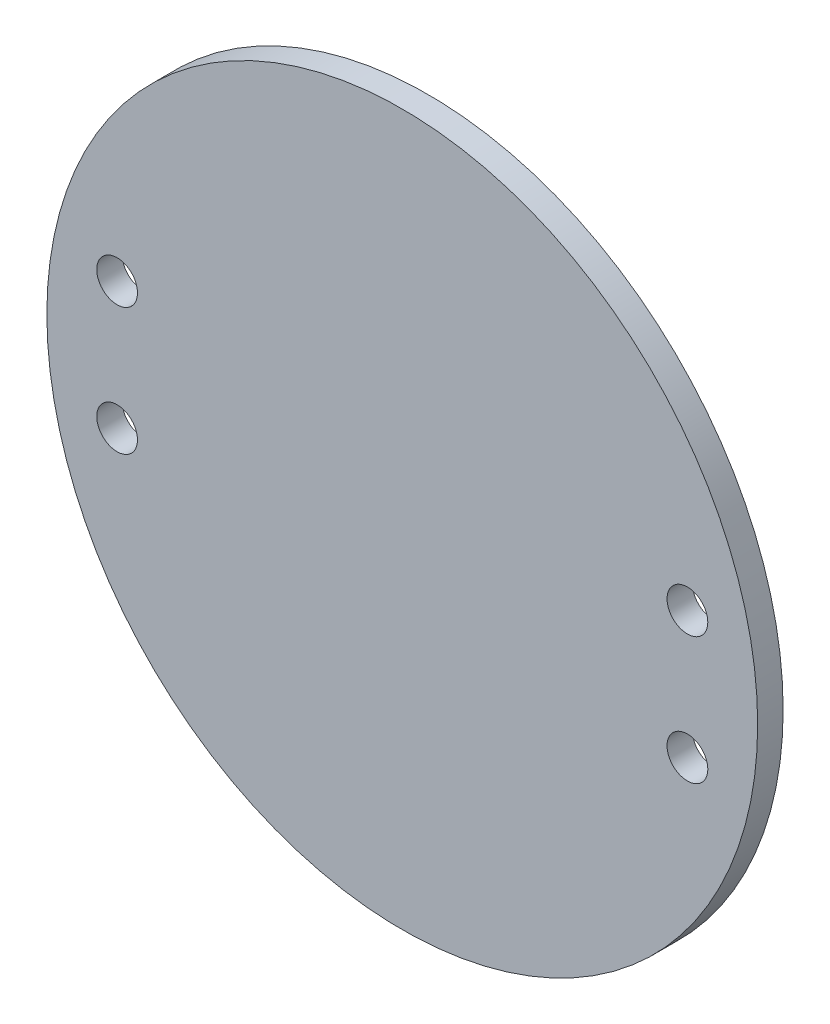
ISO-10303-21;
HEADER;
FILE_DESCRIPTION(('STEP AP214'),'2;1');
FILE_NAME('part.step','',(''),(''),'','','');
FILE_SCHEMA(('AUTOMOTIVE_DESIGN { 1 0 10303 214 1 1 1 1 }'));
ENDSEC;
DATA;
#1=APPLICATION_CONTEXT('core data for automotive mechanical design processes');
#2=APPLICATION_PROTOCOL_DEFINITION('international standard','automotive_design',2000,#1);
#3=PRODUCT_CONTEXT('',#1,'mechanical');
#4=PRODUCT('Part','Part','',(#3));
#5=PRODUCT_RELATED_PRODUCT_CATEGORY('part','',(#4));
#6=PRODUCT_DEFINITION_FORMATION('','',#4);
#7=PRODUCT_DEFINITION_CONTEXT('part definition',#1,'design');
#8=PRODUCT_DEFINITION('design','',#6,#7);
#9=PRODUCT_DEFINITION_SHAPE('','',#8);
#10=(LENGTH_UNIT() NAMED_UNIT(*) SI_UNIT(.MILLI.,.METRE.));
#11=(NAMED_UNIT(*) PLANE_ANGLE_UNIT() SI_UNIT($,.RADIAN.));
#12=(NAMED_UNIT(*) SI_UNIT($,.STERADIAN.) SOLID_ANGLE_UNIT());
#13=UNCERTAINTY_MEASURE_WITH_UNIT(LENGTH_MEASURE(1.E-05),#10,'distance_accuracy_value','');
#14=(GEOMETRIC_REPRESENTATION_CONTEXT(3) GLOBAL_UNCERTAINTY_ASSIGNED_CONTEXT((#13)) GLOBAL_UNIT_ASSIGNED_CONTEXT((#10,
#11,#12)) REPRESENTATION_CONTEXT('',''));
#15=CARTESIAN_POINT('',(0.,0.,0.));
#16=DIRECTION('',(0.,0.,1.));
#17=DIRECTION('',(1.,0.,0.));
#18=AXIS2_PLACEMENT_3D('',#15,#16,#17);
#19=CARTESIAN_POINT('',(0.,0.,1.5875));
#20=DIRECTION('',(0.,0.,1.));
#21=DIRECTION('',(1.,0.,0.));
#22=AXIS2_PLACEMENT_3D('',#19,#20,#21);
#23=PLANE('',#22);
#24=CARTESIAN_POINT('',(17.78,-3.96875,1.5875));
#25=DIRECTION('',(0.,0.,1.));
#26=DIRECTION('',(-1.,0.,0.));
#27=AXIS2_PLACEMENT_3D('',#24,#25,#26);
#28=CIRCLE('',#27,1.27);
#29=CARTESIAN_POINT('',(16.51,-3.96875,1.5875));
#30=VERTEX_POINT('',#29);
#31=EDGE_CURVE('E55',#30,#30,#28,.T.);
#32=ORIENTED_EDGE('',*,*,#31,.F.);
#33=EDGE_LOOP('',(#32));
#34=FACE_BOUND('',#33,.T.);
#35=CARTESIAN_POINT('',(-17.78,3.96875,1.5875));
#36=DIRECTION('',(0.,0.,1.));
#37=DIRECTION('',(1.,0.,0.));
#38=AXIS2_PLACEMENT_3D('',#35,#36,#37);
#39=CIRCLE('',#38,1.27);
#40=CARTESIAN_POINT('',(-16.51,3.96875,1.5875));
#41=VERTEX_POINT('',#40);
#42=EDGE_CURVE('E40',#41,#41,#39,.T.);
#43=ORIENTED_EDGE('',*,*,#42,.F.);
#44=EDGE_LOOP('',(#43));
#45=FACE_BOUND('',#44,.T.);
#46=CARTESIAN_POINT('',(0.,0.,1.5875));
#47=DIRECTION('',(0.,0.,1.));
#48=DIRECTION('',(1.,0.,0.));
#49=AXIS2_PLACEMENT_3D('',#46,#47,#48);
#50=CIRCLE('',#49,22.1615);
#51=CARTESIAN_POINT('',(22.1615,0.,1.5875));
#52=VERTEX_POINT('',#51);
#53=EDGE_CURVE('E10',#52,#52,#50,.T.);
#54=ORIENTED_EDGE('',*,*,#53,.T.);
#55=EDGE_LOOP('',(#54));
#56=FACE_BOUND('',#55,.T.);
#57=CARTESIAN_POINT('',(17.78,3.96875,1.5875));
#58=DIRECTION('',(0.,0.,1.));
#59=DIRECTION('',(1.,0.,0.));
#60=AXIS2_PLACEMENT_3D('',#57,#58,#59);
#61=CIRCLE('',#60,1.27);
#62=CARTESIAN_POINT('',(19.05,3.96875,1.5875));
#63=VERTEX_POINT('',#62);
#64=EDGE_CURVE('E49',#63,#63,#61,.T.);
#65=ORIENTED_EDGE('',*,*,#64,.F.);
#66=EDGE_LOOP('',(#65));
#67=FACE_BOUND('',#66,.T.);
#68=CARTESIAN_POINT('',(-17.78,-3.96875,1.5875));
#69=DIRECTION('',(0.,0.,1.));
#70=DIRECTION('',(-1.,0.,0.));
#71=AXIS2_PLACEMENT_3D('',#68,#69,#70);
#72=CIRCLE('',#71,1.27);
#73=CARTESIAN_POINT('',(-19.05,-3.96875,1.5875));
#74=VERTEX_POINT('',#73);
#75=EDGE_CURVE('E61',#74,#74,#72,.T.);
#76=ORIENTED_EDGE('',*,*,#75,.F.);
#77=EDGE_LOOP('',(#76));
#78=FACE_BOUND('',#77,.T.);
#79=ADVANCED_FACE('F29',(#34,#45,#56,#67,#78),#23,.T.);
#80=CARTESIAN_POINT('',(0.,0.,0.));
#81=DIRECTION('',(0.,0.,1.));
#82=DIRECTION('',(1.,0.,0.));
#83=AXIS2_PLACEMENT_3D('',#80,#81,#82);
#84=PLANE('',#83);
#85=CARTESIAN_POINT('',(17.78,-3.96875,0.));
#86=DIRECTION('',(0.,0.,1.));
#87=DIRECTION('',(-1.,0.,0.));
#88=AXIS2_PLACEMENT_3D('',#85,#86,#87);
#89=CIRCLE('',#88,1.27);
#90=CARTESIAN_POINT('',(16.51,-3.96875,0.));
#91=VERTEX_POINT('',#90);
#92=EDGE_CURVE('E58',#91,#91,#89,.T.);
#93=ORIENTED_EDGE('',*,*,#92,.T.);
#94=EDGE_LOOP('',(#93));
#95=FACE_BOUND('',#94,.T.);
#96=CARTESIAN_POINT('',(-17.78,3.96875,0.));
#97=DIRECTION('',(0.,0.,1.));
#98=DIRECTION('',(1.,0.,0.));
#99=AXIS2_PLACEMENT_3D('',#96,#97,#98);
#100=CIRCLE('',#99,1.27);
#101=CARTESIAN_POINT('',(-16.51,3.96875,0.));
#102=VERTEX_POINT('',#101);
#103=EDGE_CURVE('E44',#102,#102,#100,.T.);
#104=ORIENTED_EDGE('',*,*,#103,.T.);
#105=EDGE_LOOP('',(#104));
#106=FACE_BOUND('',#105,.T.);
#107=CARTESIAN_POINT('',(0.,0.,0.));
#108=DIRECTION('',(0.,0.,1.));
#109=DIRECTION('',(1.,0.,0.));
#110=AXIS2_PLACEMENT_3D('',#107,#108,#109);
#111=CIRCLE('',#110,22.1615);
#112=CARTESIAN_POINT('',(22.1615,0.,0.));
#113=VERTEX_POINT('',#112);
#114=EDGE_CURVE('E36',#113,#113,#111,.T.);
#115=ORIENTED_EDGE('',*,*,#114,.F.);
#116=EDGE_LOOP('',(#115));
#117=FACE_BOUND('',#116,.T.);
#118=CARTESIAN_POINT('',(17.78,3.96875,0.));
#119=DIRECTION('',(0.,0.,1.));
#120=DIRECTION('',(1.,0.,0.));
#121=AXIS2_PLACEMENT_3D('',#118,#119,#120);
#122=CIRCLE('',#121,1.27);
#123=CARTESIAN_POINT('',(19.05,3.96875,0.));
#124=VERTEX_POINT('',#123);
#125=EDGE_CURVE('E52',#124,#124,#122,.T.);
#126=ORIENTED_EDGE('',*,*,#125,.T.);
#127=EDGE_LOOP('',(#126));
#128=FACE_BOUND('',#127,.T.);
#129=CARTESIAN_POINT('',(-17.78,-3.96875,0.));
#130=DIRECTION('',(0.,0.,1.));
#131=DIRECTION('',(-1.,0.,0.));
#132=AXIS2_PLACEMENT_3D('',#129,#130,#131);
#133=CIRCLE('',#132,1.27);
#134=CARTESIAN_POINT('',(-19.05,-3.96875,0.));
#135=VERTEX_POINT('',#134);
#136=EDGE_CURVE('E64',#135,#135,#133,.T.);
#137=ORIENTED_EDGE('',*,*,#136,.T.);
#138=EDGE_LOOP('',(#137));
#139=FACE_BOUND('',#138,.T.);
#140=ADVANCED_FACE('F68',(#95,#106,#117,#128,#139),#84,.F.);
#141=CARTESIAN_POINT('',(0.,0.,1.5875));
#142=DIRECTION('',(0.,0.,-1.));
#143=DIRECTION('',(-1.,0.,0.));
#144=AXIS2_PLACEMENT_3D('',#141,#142,#143);
#145=CYLINDRICAL_SURFACE('',#144,22.1615);
#146=ORIENTED_EDGE('',*,*,#53,.F.);
#147=EDGE_LOOP('',(#146));
#148=FACE_BOUND('',#147,.T.);
#149=ORIENTED_EDGE('',*,*,#114,.T.);
#150=EDGE_LOOP('',(#149));
#151=FACE_BOUND('',#150,.T.);
#152=ADVANCED_FACE('F31',(#148,#151),#145,.T.);
#153=CARTESIAN_POINT('',(-17.78,3.96875,1.5875));
#154=DIRECTION('',(0.,0.,-1.));
#155=DIRECTION('',(-1.,0.,0.));
#156=AXIS2_PLACEMENT_3D('',#153,#154,#155);
#157=CYLINDRICAL_SURFACE('',#156,1.27);
#158=ORIENTED_EDGE('',*,*,#42,.T.);
#159=EDGE_LOOP('',(#158));
#160=FACE_BOUND('',#159,.T.);
#161=ORIENTED_EDGE('',*,*,#103,.F.);
#162=EDGE_LOOP('',(#161));
#163=FACE_BOUND('',#162,.T.);
#164=ADVANCED_FACE('F91',(#160,#163),#157,.F.);
#165=CARTESIAN_POINT('',(17.78,3.96875,1.5875));
#166=DIRECTION('',(0.,0.,-1.));
#167=DIRECTION('',(-1.,0.,0.));
#168=AXIS2_PLACEMENT_3D('',#165,#166,#167);
#169=CYLINDRICAL_SURFACE('',#168,1.27);
#170=ORIENTED_EDGE('',*,*,#64,.T.);
#171=EDGE_LOOP('',(#170));
#172=FACE_BOUND('',#171,.T.);
#173=ORIENTED_EDGE('',*,*,#125,.F.);
#174=EDGE_LOOP('',(#173));
#175=FACE_BOUND('',#174,.T.);
#176=ADVANCED_FACE('F78',(#172,#175),#169,.F.);
#177=CARTESIAN_POINT('',(17.78,-3.96875,1.5875));
#178=DIRECTION('',(0.,0.,-1.));
#179=DIRECTION('',(-1.,0.,0.));
#180=AXIS2_PLACEMENT_3D('',#177,#178,#179);
#181=CYLINDRICAL_SURFACE('',#180,1.27);
#182=ORIENTED_EDGE('',*,*,#31,.T.);
#183=EDGE_LOOP('',(#182));
#184=FACE_BOUND('',#183,.T.);
#185=ORIENTED_EDGE('',*,*,#92,.F.);
#186=EDGE_LOOP('',(#185));
#187=FACE_BOUND('',#186,.T.);
#188=ADVANCED_FACE('F72',(#184,#187),#181,.F.);
#189=CARTESIAN_POINT('',(-17.78,-3.96875,1.5875));
#190=DIRECTION('',(0.,0.,-1.));
#191=DIRECTION('',(-1.,0.,0.));
#192=AXIS2_PLACEMENT_3D('',#189,#190,#191);
#193=CYLINDRICAL_SURFACE('',#192,1.27);
#194=ORIENTED_EDGE('',*,*,#75,.T.);
#195=EDGE_LOOP('',(#194));
#196=FACE_BOUND('',#195,.T.);
#197=ORIENTED_EDGE('',*,*,#136,.F.);
#198=EDGE_LOOP('',(#197));
#199=FACE_BOUND('',#198,.T.);
#200=ADVANCED_FACE('F70',(#196,#199),#193,.F.);
#201=CLOSED_SHELL('',(#79,#140,#152,#164,#176,#188,#200));
#202=MANIFOLD_SOLID_BREP('B2',#201);
#203=ADVANCED_BREP_SHAPE_REPRESENTATION('',(#18,#202),#14);
#204=SHAPE_DEFINITION_REPRESENTATION(#9,#203);
ENDSEC;
END-ISO-10303-21;
